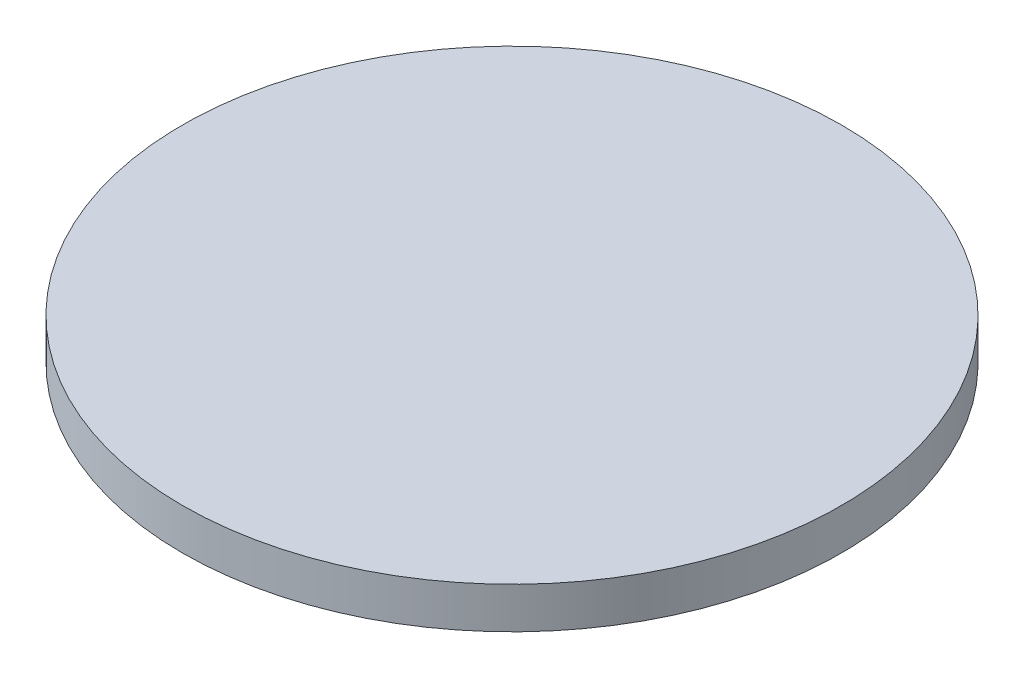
ISO-10303-21;
HEADER;
FILE_DESCRIPTION(('STEP AP214'),'2;1');
FILE_NAME('part.step','',(''),(''),'','','');
FILE_SCHEMA(('AUTOMOTIVE_DESIGN { 1 0 10303 214 1 1 1 1 }'));
ENDSEC;
DATA;
#1=APPLICATION_CONTEXT('core data for automotive mechanical design processes');
#2=APPLICATION_PROTOCOL_DEFINITION('international standard','automotive_design',2000,#1);
#3=PRODUCT_CONTEXT('',#1,'mechanical');
#4=PRODUCT('Part','Part','',(#3));
#5=PRODUCT_RELATED_PRODUCT_CATEGORY('part','',(#4));
#6=PRODUCT_DEFINITION_FORMATION('','',#4);
#7=PRODUCT_DEFINITION_CONTEXT('part definition',#1,'design');
#8=PRODUCT_DEFINITION('design','',#6,#7);
#9=PRODUCT_DEFINITION_SHAPE('','',#8);
#10=(LENGTH_UNIT() NAMED_UNIT(*) SI_UNIT(.MILLI.,.METRE.));
#11=(NAMED_UNIT(*) PLANE_ANGLE_UNIT() SI_UNIT($,.RADIAN.));
#12=(NAMED_UNIT(*) SI_UNIT($,.STERADIAN.) SOLID_ANGLE_UNIT());
#13=UNCERTAINTY_MEASURE_WITH_UNIT(LENGTH_MEASURE(1.E-05),#10,'distance_accuracy_value','');
#14=(GEOMETRIC_REPRESENTATION_CONTEXT(3) GLOBAL_UNCERTAINTY_ASSIGNED_CONTEXT((#13)) GLOBAL_UNIT_ASSIGNED_CONTEXT((#10,
#11,#12)) REPRESENTATION_CONTEXT('',''));
#15=CARTESIAN_POINT('',(0.,0.,0.));
#16=DIRECTION('',(0.,0.,1.));
#17=DIRECTION('',(1.,0.,0.));
#18=AXIS2_PLACEMENT_3D('',#15,#16,#17);
#19=CARTESIAN_POINT('',(0.,6.35,0.));
#20=DIRECTION('',(0.,-1.,0.));
#21=DIRECTION('',(0.,0.,-1.));
#22=AXIS2_PLACEMENT_3D('',#19,#20,#21);
#23=CYLINDRICAL_SURFACE('',#22,50.8);
#24=CARTESIAN_POINT('',(0.,6.35,0.));
#25=DIRECTION('',(0.,1.,0.));
#26=DIRECTION('',(0.,0.,1.));
#27=AXIS2_PLACEMENT_3D('',#24,#25,#26);
#28=CIRCLE('',#27,50.8);
#29=CARTESIAN_POINT('',(0.,6.35,50.8));
#30=VERTEX_POINT('',#29);
#31=EDGE_CURVE('E10',#30,#30,#28,.T.);
#32=ORIENTED_EDGE('',*,*,#31,.F.);
#33=EDGE_LOOP('',(#32));
#34=FACE_BOUND('',#33,.T.);
#35=CARTESIAN_POINT('',(0.,0.,0.));
#36=DIRECTION('',(0.,1.,0.));
#37=DIRECTION('',(0.,0.,1.));
#38=AXIS2_PLACEMENT_3D('',#35,#36,#37);
#39=CIRCLE('',#38,50.8);
#40=CARTESIAN_POINT('',(0.,0.,50.8));
#41=VERTEX_POINT('',#40);
#42=EDGE_CURVE('E46',#41,#41,#39,.T.);
#43=ORIENTED_EDGE('',*,*,#42,.T.);
#44=EDGE_LOOP('',(#43));
#45=FACE_BOUND('',#44,.T.);
#46=ADVANCED_FACE('F43',(#34,#45),#23,.T.);
#47=CARTESIAN_POINT('',(0.,6.35,0.));
#48=DIRECTION('',(0.,1.,0.));
#49=DIRECTION('',(0.,0.,1.));
#50=AXIS2_PLACEMENT_3D('',#47,#48,#49);
#51=PLANE('',#50);
#52=ORIENTED_EDGE('',*,*,#31,.T.);
#53=EDGE_LOOP('',(#52));
#54=FACE_BOUND('',#53,.T.);
#55=ADVANCED_FACE('F60',(#54),#51,.T.);
#56=CARTESIAN_POINT('',(0.,0.,0.));
#57=DIRECTION('',(0.,1.,0.));
#58=DIRECTION('',(0.,0.,1.));
#59=AXIS2_PLACEMENT_3D('',#56,#57,#58);
#60=PLANE('',#59);
#61=ORIENTED_EDGE('',*,*,#42,.F.);
#62=EDGE_LOOP('',(#61));
#63=FACE_BOUND('',#62,.T.);
#64=ADVANCED_FACE('F58',(#63),#60,.F.);
#65=CLOSED_SHELL('',(#46,#55,#64));
#66=MANIFOLD_SOLID_BREP('B2',#65);
#67=ADVANCED_BREP_SHAPE_REPRESENTATION('',(#18,#66),#14);
#68=SHAPE_DEFINITION_REPRESENTATION(#9,#67);
ENDSEC;
END-ISO-10303-21;
